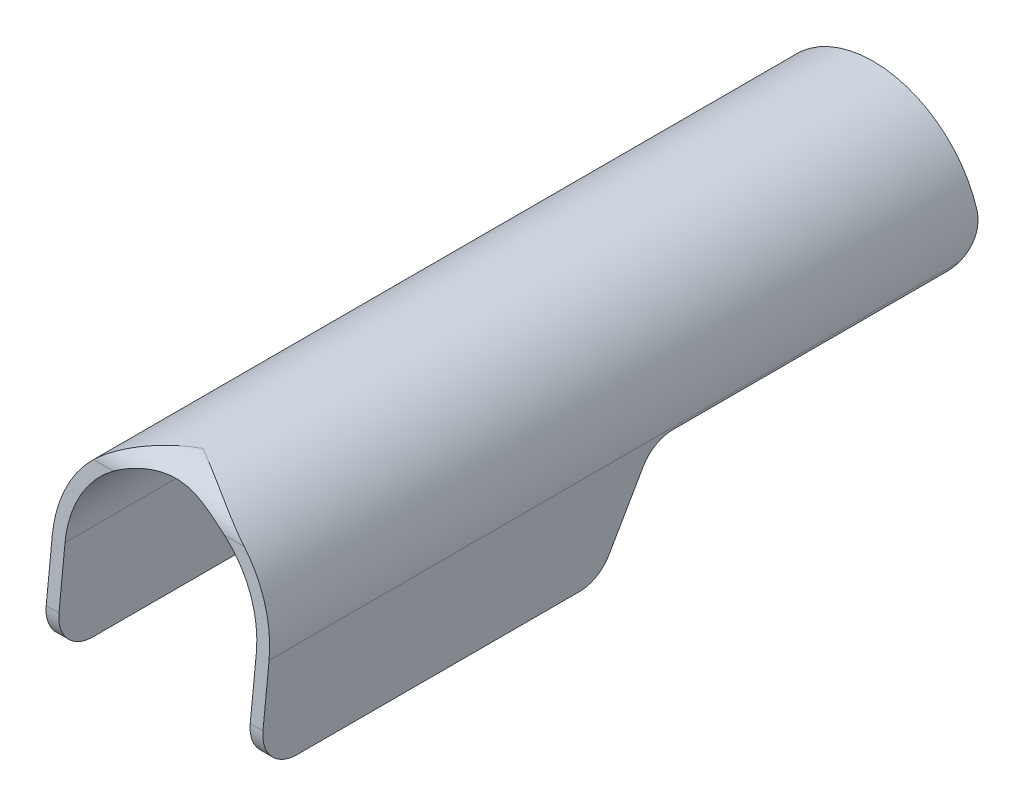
from build123d import *

# Parameters (mm, degrees)
EXTRU_MINCE1_DEPTH           = 170
ENL_V_MAT_EXTRU_1_DEPTH      = 174.78291055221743
ENL_V_MAT_EXTRU_1_DEPTH_BACK = 174.78291055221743
ESQUISSE2_OUTSIDE_W          = 208.77200000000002
ESQUISSE2_OUTSIDE_H          = 86.772


with BuildPart() as part:
    # Esquisse1 → Extru.-Mince1 (new body)
    with BuildSketch(Plane.XY):
        with BuildLine():
            Line((22.5, -22.5), (22.5, 2.63e-15))
            ThreePointArc((22.5, 2.63e-15), (2.28e-15, 22.5), (-22.5, -2.02e-15))
            Line((-22.5, -2.02e-15), (-22.499999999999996, -22.5))
            Line((-22.499999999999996, -22.5), (-25.499999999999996, -22.5))
            Line((-25.499999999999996, -22.5), (-25.5, -2.5e-15))
            ThreePointArc((-25.5, -2.29e-15), (-3.79e-15, 25.5), (25.5, 2.98e-15))
            Line((25.5, 2.63e-15), (25.5, -22.5))
            Line((25.5, -22.5), (22.5, -22.5))
        make_face()
    extrude(amount=EXTRU_MINCE1_DEPTH)

    # Esquisse2 outside → Enl_v. mat.-Extru.1 (cut, two sides: drawn at the far end of the back side and taken through both)
    with BuildSketch(Plane(origin=(0, 0, 0), x_dir=(0, 0, -1), z_dir=(1, 0, 0)).offset(-ENL_V_MAT_EXTRU_1_DEPTH_BACK)):
        with Locations((-85.00000000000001, 1.5)):
            Rectangle(ESQUISSE2_OUTSIDE_W, ESQUISSE2_OUTSIDE_H)
        with BuildLine():
            Line((-165.70793951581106, 18.33622770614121), (-169.07127504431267, -13.663772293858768))
            ThreePointArc((-169.07127504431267, -13.663772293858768), (-167.06025848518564, -19.85304485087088), (-161.11509988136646, -22.5))
            Line((-161.11509988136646, -22.5), (-94.61880215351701, -22.5))
            ThreePointArc((-94.61880215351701, -22.5), (-90.61880215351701, -21.428203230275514), (-87.69059892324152, -18.500000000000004))
            Line((-87.69059892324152, -18.500000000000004), (-79.6076951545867, -4.499999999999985))
            ThreePointArc((-79.6076951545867, -4.499999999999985), (-76.67949192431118, -1.5717967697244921), (-72.6794919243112, -0.5000000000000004))
            Line((-72.6794919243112, -0.5000000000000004), (-8, -0.5000000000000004))
            ThreePointArc((-8, -0.5000000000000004), (-2.3431457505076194, 1.8431457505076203), (0, 7.5))
            Line((0, 7.5), (0, 25.5))
            Line((0, 25.5), (-157.75176435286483, 25.499999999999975))
            ThreePointArc((-157.75176435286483, 25.499999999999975), (-163.10480920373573, 23.44515860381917), (-165.70793951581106, 18.33622770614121))
        make_face(mode=Mode.SUBTRACT)
    extrude(amount=ENL_V_MAT_EXTRU_1_DEPTH + ENL_V_MAT_EXTRU_1_DEPTH_BACK, mode=Mode.SUBTRACT)


solid = part.part
